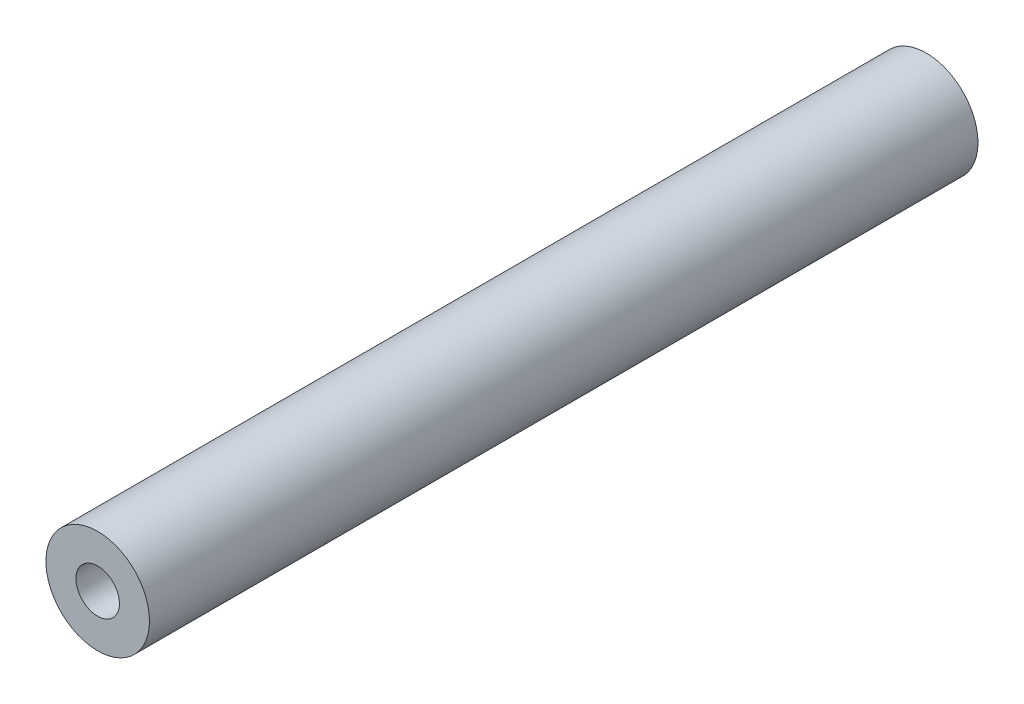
ISO-10303-21;
HEADER;
FILE_DESCRIPTION(('STEP AP214'),'2;1');
FILE_NAME('part.step','',(''),(''),'','','');
FILE_SCHEMA(('AUTOMOTIVE_DESIGN { 1 0 10303 214 1 1 1 1 }'));
ENDSEC;
DATA;
#1=APPLICATION_CONTEXT('core data for automotive mechanical design processes');
#2=APPLICATION_PROTOCOL_DEFINITION('international standard','automotive_design',2000,#1);
#3=PRODUCT_CONTEXT('',#1,'mechanical');
#4=PRODUCT('Part','Part','',(#3));
#5=PRODUCT_RELATED_PRODUCT_CATEGORY('part','',(#4));
#6=PRODUCT_DEFINITION_FORMATION('','',#4);
#7=PRODUCT_DEFINITION_CONTEXT('part definition',#1,'design');
#8=PRODUCT_DEFINITION('design','',#6,#7);
#9=PRODUCT_DEFINITION_SHAPE('','',#8);
#10=(LENGTH_UNIT() NAMED_UNIT(*) SI_UNIT(.MILLI.,.METRE.));
#11=(NAMED_UNIT(*) PLANE_ANGLE_UNIT() SI_UNIT($,.RADIAN.));
#12=(NAMED_UNIT(*) SI_UNIT($,.STERADIAN.) SOLID_ANGLE_UNIT());
#13=UNCERTAINTY_MEASURE_WITH_UNIT(LENGTH_MEASURE(1.E-05),#10,'distance_accuracy_value','');
#14=(GEOMETRIC_REPRESENTATION_CONTEXT(3) GLOBAL_UNCERTAINTY_ASSIGNED_CONTEXT((#13)) GLOBAL_UNIT_ASSIGNED_CONTEXT((#10,
#11,#12)) REPRESENTATION_CONTEXT('',''));
#15=CARTESIAN_POINT('',(0.,0.,0.));
#16=DIRECTION('',(0.,0.,1.));
#17=DIRECTION('',(1.,0.,0.));
#18=AXIS2_PLACEMENT_3D('',#15,#16,#17);
#19=CARTESIAN_POINT('',(-33.5,33.5,80.));
#20=DIRECTION('',(0.,0.,-1.));
#21=DIRECTION('',(-1.,0.,0.));
#22=AXIS2_PLACEMENT_3D('',#19,#20,#21);
#23=CYLINDRICAL_SURFACE('',#22,5.);
#24=CARTESIAN_POINT('',(-33.5,33.5,80.));
#25=DIRECTION('',(0.,0.,1.));
#26=DIRECTION('',(1.,0.,0.));
#27=AXIS2_PLACEMENT_3D('',#24,#25,#26);
#28=CIRCLE('',#27,5.);
#29=CARTESIAN_POINT('',(-28.5,33.5,80.));
#30=VERTEX_POINT('',#29);
#31=EDGE_CURVE('E11',#30,#30,#28,.T.);
#32=ORIENTED_EDGE('',*,*,#31,.F.);
#33=EDGE_LOOP('',(#32));
#34=FACE_BOUND('',#33,.T.);
#35=CARTESIAN_POINT('',(-33.5,33.5,0.));
#36=DIRECTION('',(0.,0.,1.));
#37=DIRECTION('',(1.,0.,0.));
#38=AXIS2_PLACEMENT_3D('',#35,#36,#37);
#39=CIRCLE('',#38,5.);
#40=CARTESIAN_POINT('',(-28.5,33.5,0.));
#41=VERTEX_POINT('',#40);
#42=EDGE_CURVE('E19',#41,#41,#39,.T.);
#43=ORIENTED_EDGE('',*,*,#42,.T.);
#44=EDGE_LOOP('',(#43));
#45=FACE_BOUND('',#44,.T.);
#46=ADVANCED_FACE('F16',(#34,#45),#23,.T.);
#47=CARTESIAN_POINT('',(-33.5,33.5,80.));
#48=DIRECTION('',(0.,0.,1.));
#49=DIRECTION('',(1.,0.,0.));
#50=AXIS2_PLACEMENT_3D('',#47,#48,#49);
#51=PLANE('',#50);
#52=CARTESIAN_POINT('',(-33.5,33.5,80.));
#53=DIRECTION('',(0.,0.,1.));
#54=DIRECTION('',(1.,0.,0.));
#55=AXIS2_PLACEMENT_3D('',#52,#53,#54);
#56=CIRCLE('',#55,2.1);
#57=CARTESIAN_POINT('',(-31.4,33.5,80.));
#58=VERTEX_POINT('',#57);
#59=EDGE_CURVE('E40',#58,#58,#56,.T.);
#60=ORIENTED_EDGE('',*,*,#59,.F.);
#61=EDGE_LOOP('',(#60));
#62=FACE_BOUND('',#61,.T.);
#63=ORIENTED_EDGE('',*,*,#31,.T.);
#64=EDGE_LOOP('',(#63));
#65=FACE_BOUND('',#64,.T.);
#66=ADVANCED_FACE('F58',(#62,#65),#51,.T.);
#67=CARTESIAN_POINT('',(-33.5,33.5,0.));
#68=DIRECTION('',(0.,0.,1.));
#69=DIRECTION('',(1.,0.,0.));
#70=AXIS2_PLACEMENT_3D('',#67,#68,#69);
#71=PLANE('',#70);
#72=CARTESIAN_POINT('',(-33.5,33.5,0.));
#73=DIRECTION('',(0.,0.,-1.));
#74=DIRECTION('',(-1.,0.,0.));
#75=AXIS2_PLACEMENT_3D('',#72,#73,#74);
#76=CIRCLE('',#75,2.1);
#77=CARTESIAN_POINT('',(-35.6,33.5,0.));
#78=VERTEX_POINT('',#77);
#79=EDGE_CURVE('E39',#78,#78,#76,.T.);
#80=ORIENTED_EDGE('',*,*,#79,.F.);
#81=EDGE_LOOP('',(#80));
#82=FACE_BOUND('',#81,.T.);
#83=ORIENTED_EDGE('',*,*,#42,.F.);
#84=EDGE_LOOP('',(#83));
#85=FACE_BOUND('',#84,.T.);
#86=ADVANCED_FACE('F55',(#82,#85),#71,.F.);
#87=CARTESIAN_POINT('',(-33.5,33.5,14.4));
#88=DIRECTION('',(0.,0.,-1.));
#89=DIRECTION('',(-1.,0.,0.));
#90=AXIS2_PLACEMENT_3D('',#87,#88,#89);
#91=CONICAL_SURFACE('',#90,2.1,1.02974425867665);
#92=CARTESIAN_POINT('',(-33.5,33.5,15.6618072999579));
#93=VERTEX_POINT('',#92);
#94=VERTEX_LOOP('',#93);
#95=FACE_BOUND('',#94,.T.);
#96=CARTESIAN_POINT('',(-33.5,33.5,14.4));
#97=DIRECTION('',(0.,0.,-1.));
#98=DIRECTION('',(-1.,0.,0.));
#99=AXIS2_PLACEMENT_3D('',#96,#97,#98);
#100=CIRCLE('',#99,2.1);
#101=CARTESIAN_POINT('',(-35.6,33.5,14.4));
#102=VERTEX_POINT('',#101);
#103=EDGE_CURVE('E43',#102,#102,#100,.T.);
#104=ORIENTED_EDGE('',*,*,#103,.T.);
#105=EDGE_LOOP('',(#104));
#106=FACE_BOUND('',#105,.T.);
#107=ADVANCED_FACE('F57',(#95,#106),#91,.F.);
#108=CARTESIAN_POINT('',(-33.5,33.5,0.));
#109=DIRECTION('',(0.,0.,-1.));
#110=DIRECTION('',(-1.,0.,0.));
#111=AXIS2_PLACEMENT_3D('',#108,#109,#110);
#112=CYLINDRICAL_SURFACE('',#111,2.1);
#113=ORIENTED_EDGE('',*,*,#103,.F.);
#114=EDGE_LOOP('',(#113));
#115=FACE_BOUND('',#114,.T.);
#116=ORIENTED_EDGE('',*,*,#79,.T.);
#117=EDGE_LOOP('',(#116));
#118=FACE_BOUND('',#117,.T.);
#119=ADVANCED_FACE('F33',(#115,#118),#112,.F.);
#120=CARTESIAN_POINT('',(-33.5,33.5,65.6));
#121=DIRECTION('',(0.,0.,1.));
#122=DIRECTION('',(1.,0.,0.));
#123=AXIS2_PLACEMENT_3D('',#120,#121,#122);
#124=CONICAL_SURFACE('',#123,2.1,1.02974425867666);
#125=CARTESIAN_POINT('',(-33.5,33.5,64.3381927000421));
#126=VERTEX_POINT('',#125);
#127=VERTEX_LOOP('',#126);
#128=FACE_BOUND('',#127,.T.);
#129=CARTESIAN_POINT('',(-33.5,33.5,65.6));
#130=DIRECTION('',(0.,0.,1.));
#131=DIRECTION('',(1.,0.,0.));
#132=AXIS2_PLACEMENT_3D('',#129,#130,#131);
#133=CIRCLE('',#132,2.1);
#134=CARTESIAN_POINT('',(-31.4,33.5,65.6));
#135=VERTEX_POINT('',#134);
#136=EDGE_CURVE('E37',#135,#135,#133,.T.);
#137=ORIENTED_EDGE('',*,*,#136,.T.);
#138=EDGE_LOOP('',(#137));
#139=FACE_BOUND('',#138,.T.);
#140=ADVANCED_FACE('F29',(#128,#139),#124,.F.);
#141=CARTESIAN_POINT('',(-33.5,33.5,80.));
#142=DIRECTION('',(0.,0.,1.));
#143=DIRECTION('',(1.,0.,0.));
#144=AXIS2_PLACEMENT_3D('',#141,#142,#143);
#145=CYLINDRICAL_SURFACE('',#144,2.1);
#146=ORIENTED_EDGE('',*,*,#136,.F.);
#147=EDGE_LOOP('',(#146));
#148=FACE_BOUND('',#147,.T.);
#149=ORIENTED_EDGE('',*,*,#59,.T.);
#150=EDGE_LOOP('',(#149));
#151=FACE_BOUND('',#150,.T.);
#152=ADVANCED_FACE('F32',(#148,#151),#145,.F.);
#153=CLOSED_SHELL('',(#46,#66,#86,#107,#119,#140,#152));
#154=MANIFOLD_SOLID_BREP('B1',#153);
#155=ADVANCED_BREP_SHAPE_REPRESENTATION('',(#18,#154),#14);
#156=SHAPE_DEFINITION_REPRESENTATION(#9,#155);
ENDSEC;
END-ISO-10303-21;
